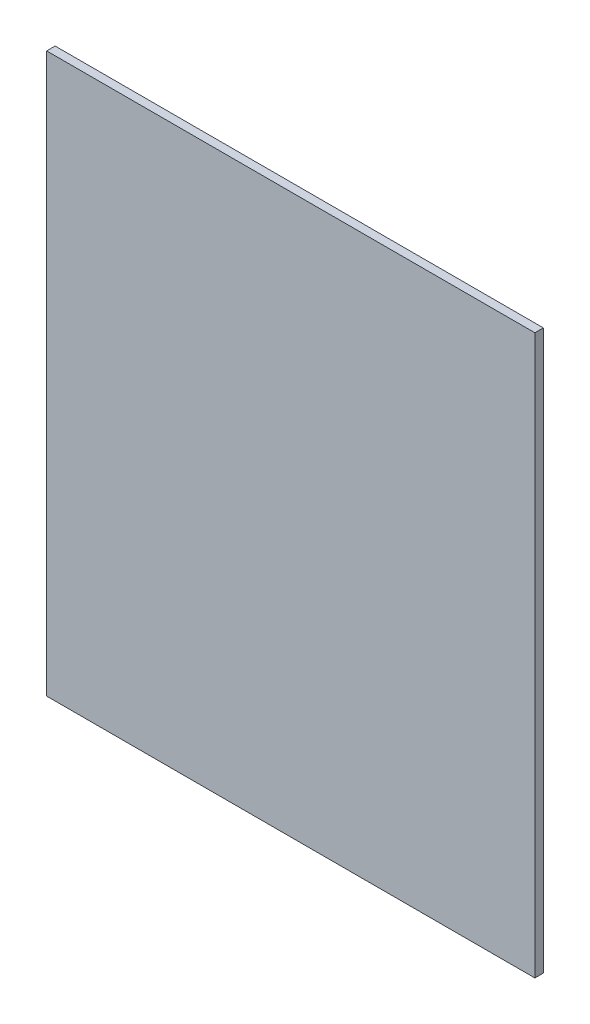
ISO-10303-21;
HEADER;
FILE_DESCRIPTION(('STEP AP214'),'2;1');
FILE_NAME('part.step','',(''),(''),'','','');
FILE_SCHEMA(('AUTOMOTIVE_DESIGN { 1 0 10303 214 1 1 1 1 }'));
ENDSEC;
DATA;
#1=APPLICATION_CONTEXT('core data for automotive mechanical design processes');
#2=APPLICATION_PROTOCOL_DEFINITION('international standard','automotive_design',2000,#1);
#3=PRODUCT_CONTEXT('',#1,'mechanical');
#4=PRODUCT('Part','Part','',(#3));
#5=PRODUCT_RELATED_PRODUCT_CATEGORY('part','',(#4));
#6=PRODUCT_DEFINITION_FORMATION('','',#4);
#7=PRODUCT_DEFINITION_CONTEXT('part definition',#1,'design');
#8=PRODUCT_DEFINITION('design','',#6,#7);
#9=PRODUCT_DEFINITION_SHAPE('','',#8);
#10=(LENGTH_UNIT() NAMED_UNIT(*) SI_UNIT(.MILLI.,.METRE.));
#11=(NAMED_UNIT(*) PLANE_ANGLE_UNIT() SI_UNIT($,.RADIAN.));
#12=(NAMED_UNIT(*) SI_UNIT($,.STERADIAN.) SOLID_ANGLE_UNIT());
#13=UNCERTAINTY_MEASURE_WITH_UNIT(LENGTH_MEASURE(1.E-05),#10,'distance_accuracy_value','');
#14=(GEOMETRIC_REPRESENTATION_CONTEXT(3) GLOBAL_UNCERTAINTY_ASSIGNED_CONTEXT((#13)) GLOBAL_UNIT_ASSIGNED_CONTEXT((#10,
#11,#12)) REPRESENTATION_CONTEXT('',''));
#15=CARTESIAN_POINT('',(0.,0.,0.));
#16=DIRECTION('',(0.,0.,1.));
#17=DIRECTION('',(1.,0.,0.));
#18=AXIS2_PLACEMENT_3D('',#15,#16,#17);
#19=CARTESIAN_POINT('',(-173.,-198.,6.));
#20=DIRECTION('',(1.,0.,0.));
#21=DIRECTION('',(0.,0.,-1.));
#22=AXIS2_PLACEMENT_3D('',#19,#20,#21);
#23=PLANE('',#22);
#24=DIRECTION('',(0.,-1.,0.));
#25=VECTOR('',#24,1.);
#26=CARTESIAN_POINT('',(-173.,-198.,0.));
#27=LINE('',#26,#25);
#28=CARTESIAN_POINT('',(-173.,198.,0.));
#29=VERTEX_POINT('',#28);
#30=CARTESIAN_POINT('',(-173.,-198.,0.));
#31=VERTEX_POINT('',#30);
#32=EDGE_CURVE('E79',#29,#31,#27,.T.);
#33=ORIENTED_EDGE('',*,*,#32,.T.);
#34=DIRECTION('',(0.,0.,-1.));
#35=VECTOR('',#34,1.);
#36=CARTESIAN_POINT('',(-173.,-198.,6.));
#37=LINE('',#36,#35);
#38=CARTESIAN_POINT('',(-173.,-198.,6.));
#39=VERTEX_POINT('',#38);
#40=EDGE_CURVE('E10',#39,#31,#37,.T.);
#41=ORIENTED_EDGE('',*,*,#40,.F.);
#42=DIRECTION('',(0.,-1.,0.));
#43=VECTOR('',#42,1.);
#44=CARTESIAN_POINT('',(-173.,-198.,6.));
#45=LINE('',#44,#43);
#46=CARTESIAN_POINT('',(-173.,198.,6.));
#47=VERTEX_POINT('',#46);
#48=EDGE_CURVE('E67',#47,#39,#45,.T.);
#49=ORIENTED_EDGE('',*,*,#48,.F.);
#50=DIRECTION('',(0.,0.,-1.));
#51=VECTOR('',#50,1.);
#52=CARTESIAN_POINT('',(-173.,198.,6.));
#53=LINE('',#52,#51);
#54=EDGE_CURVE('E75',#47,#29,#53,.T.);
#55=ORIENTED_EDGE('',*,*,#54,.T.);
#56=EDGE_LOOP('',(#33,#41,#49,#55));
#57=FACE_BOUND('',#56,.T.);
#58=ADVANCED_FACE('F16',(#57),#23,.F.);
#59=CARTESIAN_POINT('',(173.,-198.,6.));
#60=DIRECTION('',(0.,1.,0.));
#61=DIRECTION('',(-1.,0.,0.));
#62=AXIS2_PLACEMENT_3D('',#59,#60,#61);
#63=PLANE('',#62);
#64=DIRECTION('',(1.,0.,0.));
#65=VECTOR('',#64,1.);
#66=CARTESIAN_POINT('',(173.,-198.,0.));
#67=LINE('',#66,#65);
#68=CARTESIAN_POINT('',(173.,-198.,0.));
#69=VERTEX_POINT('',#68);
#70=EDGE_CURVE('E71',#31,#69,#67,.T.);
#71=ORIENTED_EDGE('',*,*,#70,.T.);
#72=DIRECTION('',(0.,0.,-1.));
#73=VECTOR('',#72,1.);
#74=CARTESIAN_POINT('',(173.,-198.,6.));
#75=LINE('',#74,#73);
#76=CARTESIAN_POINT('',(173.,-198.,6.));
#77=VERTEX_POINT('',#76);
#78=EDGE_CURVE('E24',#77,#69,#75,.T.);
#79=ORIENTED_EDGE('',*,*,#78,.F.);
#80=DIRECTION('',(1.,0.,0.));
#81=VECTOR('',#80,1.);
#82=CARTESIAN_POINT('',(173.,-198.,6.));
#83=LINE('',#82,#81);
#84=EDGE_CURVE('E62',#39,#77,#83,.T.);
#85=ORIENTED_EDGE('',*,*,#84,.F.);
#86=ORIENTED_EDGE('',*,*,#40,.T.);
#87=EDGE_LOOP('',(#71,#79,#85,#86));
#88=FACE_BOUND('',#87,.T.);
#89=ADVANCED_FACE('F70',(#88),#63,.F.);
#90=CARTESIAN_POINT('',(173.,-198.,6.));
#91=DIRECTION('',(-1.,0.,0.));
#92=DIRECTION('',(0.,0.,1.));
#93=AXIS2_PLACEMENT_3D('',#90,#91,#92);
#94=PLANE('',#93);
#95=DIRECTION('',(0.,1.,0.));
#96=VECTOR('',#95,1.);
#97=CARTESIAN_POINT('',(173.,-198.,0.));
#98=LINE('',#97,#96);
#99=CARTESIAN_POINT('',(173.,198.,0.));
#100=VERTEX_POINT('',#99);
#101=EDGE_CURVE('E49',#69,#100,#98,.T.);
#102=ORIENTED_EDGE('',*,*,#101,.T.);
#103=DIRECTION('',(0.,0.,-1.));
#104=VECTOR('',#103,1.);
#105=CARTESIAN_POINT('',(173.,198.,6.));
#106=LINE('',#105,#104);
#107=CARTESIAN_POINT('',(173.,198.,6.));
#108=VERTEX_POINT('',#107);
#109=EDGE_CURVE('E72',#108,#100,#106,.T.);
#110=ORIENTED_EDGE('',*,*,#109,.F.);
#111=DIRECTION('',(0.,1.,0.));
#112=VECTOR('',#111,1.);
#113=CARTESIAN_POINT('',(173.,-198.,6.));
#114=LINE('',#113,#112);
#115=EDGE_CURVE('E65',#77,#108,#114,.T.);
#116=ORIENTED_EDGE('',*,*,#115,.F.);
#117=ORIENTED_EDGE('',*,*,#78,.T.);
#118=EDGE_LOOP('',(#102,#110,#116,#117));
#119=FACE_BOUND('',#118,.T.);
#120=ADVANCED_FACE('F73',(#119),#94,.F.);
#121=CARTESIAN_POINT('',(173.,198.,6.));
#122=DIRECTION('',(0.,-1.,0.));
#123=DIRECTION('',(1.,0.,0.));
#124=AXIS2_PLACEMENT_3D('',#121,#122,#123);
#125=PLANE('',#124);
#126=DIRECTION('',(-1.,0.,0.));
#127=VECTOR('',#126,1.);
#128=CARTESIAN_POINT('',(173.,198.,0.));
#129=LINE('',#128,#127);
#130=EDGE_CURVE('E55',#100,#29,#129,.T.);
#131=ORIENTED_EDGE('',*,*,#130,.T.);
#132=ORIENTED_EDGE('',*,*,#54,.F.);
#133=DIRECTION('',(-1.,0.,0.));
#134=VECTOR('',#133,1.);
#135=CARTESIAN_POINT('',(173.,198.,6.));
#136=LINE('',#135,#134);
#137=EDGE_CURVE('E32',#108,#47,#136,.T.);
#138=ORIENTED_EDGE('',*,*,#137,.F.);
#139=ORIENTED_EDGE('',*,*,#109,.T.);
#140=EDGE_LOOP('',(#131,#132,#138,#139));
#141=FACE_BOUND('',#140,.T.);
#142=ADVANCED_FACE('F86',(#141),#125,.F.);
#143=CARTESIAN_POINT('',(0.,0.,6.));
#144=DIRECTION('',(0.,0.,1.));
#145=DIRECTION('',(1.,0.,0.));
#146=AXIS2_PLACEMENT_3D('',#143,#144,#145);
#147=PLANE('',#146);
#148=ORIENTED_EDGE('',*,*,#48,.T.);
#149=ORIENTED_EDGE('',*,*,#84,.T.);
#150=ORIENTED_EDGE('',*,*,#115,.T.);
#151=ORIENTED_EDGE('',*,*,#137,.T.);
#152=EDGE_LOOP('',(#148,#149,#150,#151));
#153=FACE_BOUND('',#152,.T.);
#154=ADVANCED_FACE('F63',(#153),#147,.T.);
#155=CARTESIAN_POINT('',(0.,0.,0.));
#156=DIRECTION('',(0.,0.,1.));
#157=DIRECTION('',(1.,0.,0.));
#158=AXIS2_PLACEMENT_3D('',#155,#156,#157);
#159=PLANE('',#158);
#160=ORIENTED_EDGE('',*,*,#32,.F.);
#161=ORIENTED_EDGE('',*,*,#130,.F.);
#162=ORIENTED_EDGE('',*,*,#101,.F.);
#163=ORIENTED_EDGE('',*,*,#70,.F.);
#164=EDGE_LOOP('',(#160,#161,#162,#163));
#165=FACE_BOUND('',#164,.T.);
#166=ADVANCED_FACE('F89',(#165),#159,.F.);
#167=CLOSED_SHELL('',(#58,#89,#120,#142,#154,#166));
#168=MANIFOLD_SOLID_BREP('B1',#167);
#169=ADVANCED_BREP_SHAPE_REPRESENTATION('',(#18,#168),#14);
#170=SHAPE_DEFINITION_REPRESENTATION(#9,#169);
ENDSEC;
END-ISO-10303-21;
